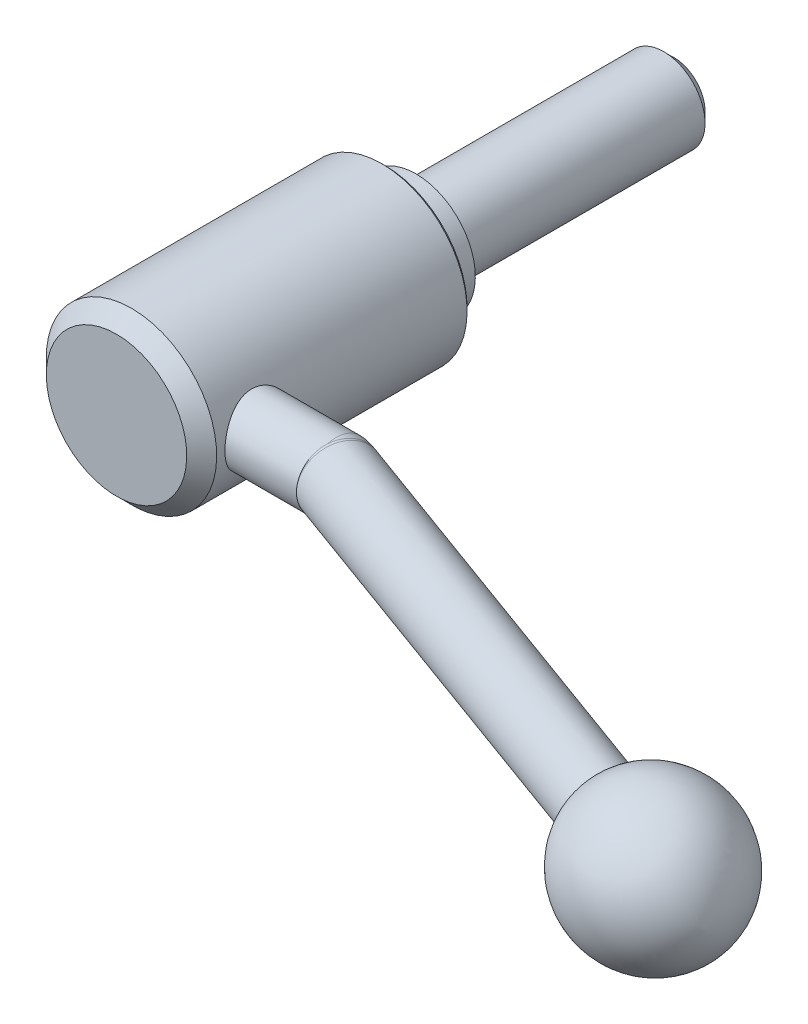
ISO-10303-21;
HEADER;
FILE_DESCRIPTION(('STEP AP214'),'2;1');
FILE_NAME('part.step','',(''),(''),'','','');
FILE_SCHEMA(('AUTOMOTIVE_DESIGN { 1 0 10303 214 1 1 1 1 }'));
ENDSEC;
DATA;
#1=APPLICATION_CONTEXT('core data for automotive mechanical design processes');
#2=APPLICATION_PROTOCOL_DEFINITION('international standard','automotive_design',2000,#1);
#3=PRODUCT_CONTEXT('',#1,'mechanical');
#4=PRODUCT('Part','Part','',(#3));
#5=PRODUCT_RELATED_PRODUCT_CATEGORY('part','',(#4));
#6=PRODUCT_DEFINITION_FORMATION('','',#4);
#7=PRODUCT_DEFINITION_CONTEXT('part definition',#1,'design');
#8=PRODUCT_DEFINITION('design','',#6,#7);
#9=PRODUCT_DEFINITION_SHAPE('','',#8);
#10=(LENGTH_UNIT() NAMED_UNIT(*) SI_UNIT(.MILLI.,.METRE.));
#11=(NAMED_UNIT(*) PLANE_ANGLE_UNIT() SI_UNIT($,.RADIAN.));
#12=(NAMED_UNIT(*) SI_UNIT($,.STERADIAN.) SOLID_ANGLE_UNIT());
#13=UNCERTAINTY_MEASURE_WITH_UNIT(LENGTH_MEASURE(1.E-05),#10,'distance_accuracy_value','');
#14=(GEOMETRIC_REPRESENTATION_CONTEXT(3) GLOBAL_UNCERTAINTY_ASSIGNED_CONTEXT((#13)) GLOBAL_UNIT_ASSIGNED_CONTEXT((#10,
#11,#12)) REPRESENTATION_CONTEXT('',''));
#15=CARTESIAN_POINT('',(0.,0.,0.));
#16=DIRECTION('',(0.,0.,1.));
#17=DIRECTION('',(1.,0.,0.));
#18=AXIS2_PLACEMENT_3D('',#15,#16,#17);
#19=CARTESIAN_POINT('',(0.,0.,0.));
#20=DIRECTION('',(0.,0.,-1.));
#21=DIRECTION('',(0.,1.,0.));
#22=AXIS2_PLACEMENT_3D('',#19,#20,#21);
#23=CYLINDRICAL_SURFACE('',#22,16.5);
#24=CARTESIAN_POINT('',(0.,0.,6.6));
#25=DIRECTION('',(0.,0.,-1.));
#26=DIRECTION('',(0.,1.,0.));
#27=AXIS2_PLACEMENT_3D('',#24,#25,#26);
#28=CIRCLE('',#27,16.5);
#29=CARTESIAN_POINT('',(0.,16.5,6.6));
#30=VERTEX_POINT('',#29);
#31=EDGE_CURVE('E147',#30,#30,#28,.T.);
#32=ORIENTED_EDGE('',*,*,#31,.F.);
#33=EDGE_LOOP('',(#32));
#34=FACE_BOUND('',#33,.T.);
#35=CARTESIAN_POINT('',(15.1657508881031,6.5,47.));
#36=CARTESIAN_POINT('',(15.1657521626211,6.49999870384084,47.1744094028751));
#37=CARTESIAN_POINT('',(15.1687696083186,6.49297069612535,47.3488754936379));
#38=CARTESIAN_POINT('',(15.180743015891,6.4649258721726,47.6965510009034));
#39=CARTESIAN_POINT('',(15.1897026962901,6.44390029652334,47.8697595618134));
#40=CARTESIAN_POINT('',(15.2132851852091,6.38802582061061,48.2139084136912));
#41=CARTESIAN_POINT('',(15.2279195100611,6.35314880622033,48.3848433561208));
#42=CARTESIAN_POINT('',(15.2623783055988,6.26991497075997,48.722930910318));
#43=CARTESIAN_POINT('',(15.2822049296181,6.22155255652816,48.890081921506));
#44=CARTESIAN_POINT('',(15.3263305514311,6.11204204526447,49.2187433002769));
#45=CARTESIAN_POINT('',(15.3506106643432,6.05094779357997,49.3802741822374));
#46=CARTESIAN_POINT('',(15.4029879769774,5.91634808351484,49.6975038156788));
#47=CARTESIAN_POINT('',(15.4310866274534,5.84283790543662,49.8532003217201));
#48=CARTESIAN_POINT('',(15.4902847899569,5.68403460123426,50.1577239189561));
#49=CARTESIAN_POINT('',(15.521382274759,5.59874941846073,50.3065555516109));
#50=CARTESIAN_POINT('',(15.5857773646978,5.41690395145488,50.5967321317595));
#51=CARTESIAN_POINT('',(15.6190757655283,5.32033957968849,50.7380743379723));
#52=CARTESIAN_POINT('',(15.6887204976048,5.11143504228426,51.0193834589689));
#53=CARTESIAN_POINT('',(15.7251359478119,4.99854682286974,51.1589265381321));
#54=CARTESIAN_POINT('',(15.7984684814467,4.76169722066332,51.4281356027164));
#55=CARTESIAN_POINT('',(15.8353855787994,4.6377355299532,51.5578013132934));
#56=CARTESIAN_POINT('',(15.9087724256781,4.37938333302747,51.8065762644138));
#57=CARTESIAN_POINT('',(15.9452419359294,4.24498750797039,51.9256800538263));
#58=CARTESIAN_POINT('',(16.0167582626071,3.96662276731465,52.1524872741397));
#59=CARTESIAN_POINT('',(16.0518055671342,3.82265718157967,52.2601946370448));
#60=CARTESIAN_POINT('',(16.1208941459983,3.52019152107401,52.467462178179));
#61=CARTESIAN_POINT('',(16.1548445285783,3.3613450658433,52.5665481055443));
#62=CARTESIAN_POINT('',(16.2192807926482,3.03521726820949,52.7508716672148));
#63=CARTESIAN_POINT('',(16.2497679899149,2.86793916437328,52.8361145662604));
#64=CARTESIAN_POINT('',(16.306415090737,2.52603369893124,52.9920322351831));
#65=CARTESIAN_POINT('',(16.3325754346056,2.35140708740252,53.062708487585));
#66=CARTESIAN_POINT('',(16.3798001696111,1.99606140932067,53.1888023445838));
#67=CARTESIAN_POINT('',(16.4008648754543,1.81534271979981,53.2442208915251));
#68=CARTESIAN_POINT('',(16.4364052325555,1.45784632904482,53.3369679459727));
#69=CARTESIAN_POINT('',(16.4511444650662,1.28128382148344,53.3750254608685));
#70=CARTESIAN_POINT('',(16.4750042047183,0.925236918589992,53.4363470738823));
#71=CARTESIAN_POINT('',(16.4841250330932,0.745752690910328,53.4596120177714));
#72=CARTESIAN_POINT('',(16.4964855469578,0.38532015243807,53.4910896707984));
#73=CARTESIAN_POINT('',(16.4997269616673,0.204372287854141,53.4993068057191));
#74=CARTESIAN_POINT('',(16.5002398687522,-0.157583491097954,53.500608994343));
#75=CARTESIAN_POINT('',(16.4975115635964,-0.33859140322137,53.4936945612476));
#76=CARTESIAN_POINT('',(16.4864766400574,-0.689328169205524,53.465606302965));
#77=CARTESIAN_POINT('',(16.4784837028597,-0.85913183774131,53.4452341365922));
#78=CARTESIAN_POINT('',(16.4574384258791,-1.19635679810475,53.3912360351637));
#79=CARTESIAN_POINT('',(16.444384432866,-1.36377729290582,53.3576057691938));
#80=CARTESIAN_POINT('',(16.4135516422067,-1.69498665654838,53.2774234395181));
#81=CARTESIAN_POINT('',(16.3957743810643,-1.85877668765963,53.2308755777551));
#82=CARTESIAN_POINT('',(16.3559249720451,-2.18179127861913,53.1252488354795));
#83=CARTESIAN_POINT('',(16.3338511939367,-2.34101407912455,53.0661651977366));
#84=CARTESIAN_POINT('',(16.2855961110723,-2.65615140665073,52.9350157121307));
#85=CARTESIAN_POINT('',(16.2593596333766,-2.81198390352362,52.8627732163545));
#86=CARTESIAN_POINT('',(16.2036445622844,-3.11704287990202,52.7064377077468));
#87=CARTESIAN_POINT('',(16.1741648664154,-3.26626708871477,52.6223406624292));
#88=CARTESIAN_POINT('',(16.1126670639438,-3.55725721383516,52.4428984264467));
#89=CARTESIAN_POINT('',(16.0806487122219,-3.69902240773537,52.3475521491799));
#90=CARTESIAN_POINT('',(16.0148235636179,-3.97435099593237,52.1462241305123));
#91=CARTESIAN_POINT('',(15.9810166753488,-4.10791397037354,52.0402418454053));
#92=CARTESIAN_POINT('',(15.9101988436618,-4.37444690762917,51.8111373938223));
#93=CARTESIAN_POINT('',(15.8731214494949,-4.50682971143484,51.687351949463));
#94=CARTESIAN_POINT('',(15.7988232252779,-4.76074389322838,51.4292307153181));
#95=CARTESIAN_POINT('',(15.7616024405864,-4.88227844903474,51.2948980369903));
#96=CARTESIAN_POINT('',(15.6879834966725,-5.11389804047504,51.0163266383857));
#97=CARTESIAN_POINT('',(15.6515859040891,-5.22397536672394,50.8720813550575));
#98=CARTESIAN_POINT('',(15.5806672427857,-5.43183822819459,50.5746385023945));
#99=CARTESIAN_POINT('',(15.5461454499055,-5.52962852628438,50.4214444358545));
#100=CARTESIAN_POINT('',(15.4790662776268,-5.71475871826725,50.1026478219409));
#101=CARTESIAN_POINT('',(15.4465879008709,-5.80174188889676,49.936821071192));
#102=CARTESIAN_POINT('',(15.3857195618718,-5.96128563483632,49.5977234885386));
#103=CARTESIAN_POINT('',(15.3573279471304,-6.03385204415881,49.4244557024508));
#104=CARTESIAN_POINT('',(15.3055990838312,-6.16388979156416,49.0716641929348));
#105=CARTESIAN_POINT('',(15.2822603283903,-6.22136563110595,48.8921423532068));
#106=CARTESIAN_POINT('',(15.2414756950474,-6.32062540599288,48.5281589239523));
#107=CARTESIAN_POINT('',(15.2240293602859,-6.36241055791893,48.3436977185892));
#108=CARTESIAN_POINT('',(15.1965377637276,-6.42778493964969,47.9824635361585));
#109=CARTESIAN_POINT('',(15.1861129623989,-6.45231123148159,47.8058886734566));
#110=CARTESIAN_POINT('',(15.1714222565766,-6.48677897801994,47.4510697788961));
#111=CARTESIAN_POINT('',(15.1671560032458,-6.4967212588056,47.2728258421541));
#112=CARTESIAN_POINT('',(15.1649343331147,-6.5019054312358,46.9161296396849));
#113=CARTESIAN_POINT('',(15.1669773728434,-6.49715091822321,46.7376774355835));
#114=CARTESIAN_POINT('',(15.1772980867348,-6.47300508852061,46.3819515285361));
#115=CARTESIAN_POINT('',(15.1855756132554,-6.45361411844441,46.2046777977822));
#116=CARTESIAN_POINT('',(15.2074545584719,-6.40187966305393,45.8623519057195));
#117=CARTESIAN_POINT('',(15.2207392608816,-6.37030447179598,45.6971624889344));
#118=CARTESIAN_POINT('',(15.2522135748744,-6.29457395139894,45.3701161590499));
#119=CARTESIAN_POINT('',(15.2704047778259,-6.25041454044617,45.2082603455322));
#120=CARTESIAN_POINT('',(15.3111508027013,-6.1499265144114,44.8889788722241));
#121=CARTESIAN_POINT('',(15.3337047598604,-6.09360031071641,44.7315523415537));
#122=CARTESIAN_POINT('',(15.3825547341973,-5.9692104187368,44.4219440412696));
#123=CARTESIAN_POINT('',(15.4088521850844,-5.90114223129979,44.2697643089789));
#124=CARTESIAN_POINT('',(15.4655807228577,-5.75087055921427,43.9656332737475));
#125=CARTESIAN_POINT('',(15.496133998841,-5.66821518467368,43.8139280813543));
#126=CARTESIAN_POINT('',(15.5596953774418,-5.4913305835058,43.5178983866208));
#127=CARTESIAN_POINT('',(15.5927043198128,-5.39709739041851,43.373576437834));
#128=CARTESIAN_POINT('',(15.6603145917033,-5.19765644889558,43.093084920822));
#129=CARTESIAN_POINT('',(15.6949161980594,-5.09244678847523,42.9569167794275));
#130=CARTESIAN_POINT('',(15.7648419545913,-4.87166967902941,42.6934495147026));
#131=CARTESIAN_POINT('',(15.8001661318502,-4.75610184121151,42.5661507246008));
#132=CARTESIAN_POINT('',(15.8732028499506,-4.50660710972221,42.3123157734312));
#133=CARTESIAN_POINT('',(15.910905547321,-4.37195833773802,42.1864851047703));
#134=CARTESIAN_POINT('',(15.985112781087,-4.09232041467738,41.9466012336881));
#135=CARTESIAN_POINT('',(16.0216176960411,-3.94733457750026,41.8325442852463));
#136=CARTESIAN_POINT('',(16.0924669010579,-3.64776716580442,41.6168903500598));
#137=CARTESIAN_POINT('',(16.1268102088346,-3.4931812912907,41.5152990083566));
#138=CARTESIAN_POINT('',(16.192362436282,-3.17548270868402,41.3254483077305));
#139=CARTESIAN_POINT('',(16.2235726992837,-3.01237370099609,41.2371832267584));
#140=CARTESIAN_POINT('',(16.2819868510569,-2.67872446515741,41.0747287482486));
#141=CARTESIAN_POINT('',(16.3091932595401,-2.50818899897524,41.0005304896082));
#142=CARTESIAN_POINT('',(16.3588360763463,-2.16084294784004,40.8668630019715));
#143=CARTESIAN_POINT('',(16.3812744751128,-1.98403501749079,40.8073876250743));
#144=CARTESIAN_POINT('',(16.4207336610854,-1.62543340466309,40.7037478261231));
#145=CARTESIAN_POINT('',(16.4377556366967,-1.44364082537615,40.6595800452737));
#146=CARTESIAN_POINT('',(16.4658759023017,-1.0764844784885,40.5870294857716));
#147=CARTESIAN_POINT('',(16.4769745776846,-0.89112094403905,40.5586456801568));
#148=CARTESIAN_POINT('',(16.4924035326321,-0.530232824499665,40.5192842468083));
#149=CARTESIAN_POINT('',(16.4971193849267,-0.354832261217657,40.5073144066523));
#150=CARTESIAN_POINT('',(16.5009342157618,-0.003578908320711,40.4976272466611));
#151=CARTESIAN_POINT('',(16.5000333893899,0.172273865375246,40.4999094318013));
#152=CARTESIAN_POINT('',(16.492639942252,0.523072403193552,40.5187002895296));
#153=CARTESIAN_POINT('',(16.4861480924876,0.698018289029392,40.5352070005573));
#154=CARTESIAN_POINT('',(16.4677497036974,1.04571908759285,40.5822707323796));
#155=CARTESIAN_POINT('',(16.4558431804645,1.21847400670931,40.6128277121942));
#156=CARTESIAN_POINT('',(16.427359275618,1.55551611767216,40.6865815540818));
#157=CARTESIAN_POINT('',(16.4109292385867,1.71990302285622,40.7293811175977));
#158=CARTESIAN_POINT('',(16.3736686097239,2.04442213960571,40.8275543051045));
#159=CARTESIAN_POINT('',(16.3528365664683,2.20455292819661,40.8829320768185));
#160=CARTESIAN_POINT('',(16.3072831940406,2.51948953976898,41.0057747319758));
#161=CARTESIAN_POINT('',(16.2825627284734,2.67429653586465,41.0732369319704));
#162=CARTESIAN_POINT('',(16.2298017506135,2.977796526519,41.2197632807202));
#163=CARTESIAN_POINT('',(16.201759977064,3.12648716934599,41.2988318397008));
#164=CARTESIAN_POINT('',(16.1417339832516,3.42320288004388,41.4716706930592));
#165=CARTESIAN_POINT('',(16.1096315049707,3.5709192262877,41.565929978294));
#166=CARTESIAN_POINT('',(16.0433028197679,3.85799821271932,41.7658374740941));
#167=CARTESIAN_POINT('',(16.0090758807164,3.99735794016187,41.8714896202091));
#168=CARTESIAN_POINT('',(15.9393375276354,4.266955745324,42.0935156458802));
#169=CARTESIAN_POINT('',(15.9038258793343,4.39719214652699,42.2098914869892));
#170=CARTESIAN_POINT('',(15.8323930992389,4.647828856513,42.4526787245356));
#171=CARTESIAN_POINT('',(15.796471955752,4.76822888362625,42.5790904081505));
#172=CARTESIAN_POINT('',(15.7229728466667,5.00544246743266,42.8491269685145));
#173=CARTESIAN_POINT('',(15.6854245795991,5.12160881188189,42.9933293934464));
#174=CARTESIAN_POINT('',(15.6119611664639,5.34135661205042,43.2913381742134));
#175=CARTESIAN_POINT('',(15.5760454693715,5.44494233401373,43.4451412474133));
#176=CARTESIAN_POINT('',(15.5068861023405,5.63889116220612,43.76158008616));
#177=CARTESIAN_POINT('',(15.4736440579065,5.72924625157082,43.9242211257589));
#178=CARTESIAN_POINT('',(15.4109193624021,5.89588782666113,44.2571658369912));
#179=CARTESIAN_POINT('',(15.3814348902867,5.9721811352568,44.427465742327));
#180=CARTESIAN_POINT('',(15.3295715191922,6.10399903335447,44.7594125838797));
#181=CARTESIAN_POINT('',(15.3067961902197,6.16075841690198,44.9205080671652));
#182=CARTESIAN_POINT('',(15.2658533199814,6.26152405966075,45.2471430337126));
#183=CARTESIAN_POINT('',(15.2476836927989,6.30553609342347,45.4126804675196));
#184=CARTESIAN_POINT('',(15.2165340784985,6.38033934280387,45.7467976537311));
#185=CARTESIAN_POINT('',(15.2035424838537,6.41116014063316,45.9153697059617));
#186=CARTESIAN_POINT('',(15.183110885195,6.45939917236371,46.2546841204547));
#187=CARTESIAN_POINT('',(15.1756675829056,6.4768253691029,46.4254251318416));
#188=CARTESIAN_POINT('',(15.1693292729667,6.49164558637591,46.6637445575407));
#189=CARTESIAN_POINT('',(15.1679883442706,6.49477751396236,46.7309454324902));
#190=CARTESIAN_POINT('',(15.1661988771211,6.49895503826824,46.8654280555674));
#191=CARTESIAN_POINT('',(15.1657503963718,6.50000050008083,46.9327098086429));
#192=CARTESIAN_POINT('',(15.1657508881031,6.5,47.));
#193=B_SPLINE_CURVE_WITH_KNOTS('',3,(#35,#36,#37,#38,#39,#40,#41,#42,#43,#44,#45,#46,#47,#48,
#49,#50,#51,#52,#53,#54,#55,#56,#57,#58,#59,#60,#61,#62,#63,#64,#65,#66,#67,#68,#69,#70,#71,#72,
#73,#74,#75,#76,#77,#78,#79,#80,#81,#82,#83,#84,#85,#86,#87,#88,#89,#90,#91,#92,#93,#94,#95,#96,
#97,#98,#99,#100,#101,#102,#103,#104,#105,#106,#107,#108,#109,#110,#111,#112,#113,#114,#115,
#116,#117,#118,#119,#120,#121,#122,#123,#124,#125,#126,#127,#128,#129,#130,#131,#132,#133,#134,
#135,#136,#137,#138,#139,#140,#141,#142,#143,#144,#145,#146,#147,#148,#149,#150,#151,#152,#153,
#154,#155,#156,#157,#158,#159,#160,#161,#162,#163,#164,#165,#166,#167,#168,#169,#170,#171,#172,
#173,#174,#175,#176,#177,#178,#179,#180,#181,#182,#183,#184,#185,#186,#187,#188,#189,#190,#191,
#192),.UNSPECIFIED.,.T.,.F.,(4,2,2,2,2,2,2,2,2,2,2,2,2,2,2,2,2,2,2,2,2,2,2,2,2,2,2,2,2,2,2,2,2,
2,2,2,2,2,2,2,2,2,2,2,2,2,2,2,2,2,2,2,2,2,2,2,2,2,2,2,2,2,2,2,2,2,2,2,2,2,2,2,2,2,2,2,2,2,4),
(0.,0.523159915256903,1.04664752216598,1.5712031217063,2.09597660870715,2.61857420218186,
3.14137090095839,3.66381663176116,4.18645228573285,4.73527747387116,5.28411792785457,
5.83324001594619,6.38217202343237,6.95226912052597,7.52214888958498,8.09197063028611,
8.66175716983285,9.20471085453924,9.74763349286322,10.2903964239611,10.8331409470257,
11.3461618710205,11.8593505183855,12.3723724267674,12.8855893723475,13.4062856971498,
13.9271595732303,14.4480838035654,14.9690346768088,15.5233891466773,16.0775806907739,
16.6321427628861,17.186489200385,17.755918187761,18.3251162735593,18.894144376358,
19.4631283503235,19.9981572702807,20.533155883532,21.0680236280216,21.6028787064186,
22.1084143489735,22.6141141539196,23.11971382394,23.6255076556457,24.1512658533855,
24.6772046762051,25.2032352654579,25.7292856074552,26.2929535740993,26.8564416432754,
27.4201839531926,27.9836835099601,28.5468269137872,29.1097347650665,29.6725190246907,
30.235266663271,30.7622239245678,31.2891628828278,31.8160291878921,32.3428939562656,
32.8542954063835,33.3658657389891,33.8773226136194,34.3889743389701,34.9228229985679,
35.4568566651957,35.990988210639,36.5251350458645,37.0912887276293,37.6572498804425,
38.2235525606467,38.7895797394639,39.3059532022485,39.8220923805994,40.3370679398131,
40.851737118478,41.0535682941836,41.2554125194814),.UNSPECIFIED.);
#194=CARTESIAN_POINT('',(15.1657508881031,6.5,47.));
#195=VERTEX_POINT('',#194);
#196=EDGE_CURVE('E77',#195,#195,#193,.T.);
#197=ORIENTED_EDGE('',*,*,#196,.F.);
#198=EDGE_LOOP('',(#197));
#199=FACE_BOUND('',#198,.T.);
#200=CARTESIAN_POINT('',(0.,0.,55.1));
#201=DIRECTION('',(0.,0.,-1.));
#202=DIRECTION('',(0.,1.,0.));
#203=AXIS2_PLACEMENT_3D('',#200,#201,#202);
#204=CIRCLE('',#203,16.5);
#205=CARTESIAN_POINT('',(0.,16.5,55.1));
#206=VERTEX_POINT('',#205);
#207=EDGE_CURVE('E149',#206,#206,#204,.T.);
#208=ORIENTED_EDGE('',*,*,#207,.T.);
#209=EDGE_LOOP('',(#208));
#210=FACE_BOUND('',#209,.T.);
#211=ADVANCED_FACE('F14',(#34,#199,#210),#23,.T.);
#212=CARTESIAN_POINT('',(0.,0.,58.));
#213=DIRECTION('',(0.,0.,-1.));
#214=DIRECTION('',(0.,1.,0.));
#215=AXIS2_PLACEMENT_3D('',#212,#213,#214);
#216=PLANE('',#215);
#217=CARTESIAN_POINT('',(0.,0.,58.));
#218=DIRECTION('',(0.,0.,-1.));
#219=DIRECTION('',(0.,1.,0.));
#220=AXIS2_PLACEMENT_3D('',#217,#218,#219);
#221=CIRCLE('',#220,13.6);
#222=CARTESIAN_POINT('',(0.,13.6,58.));
#223=VERTEX_POINT('',#222);
#224=EDGE_CURVE('E85',#223,#223,#221,.T.);
#225=ORIENTED_EDGE('',*,*,#224,.F.);
#226=EDGE_LOOP('',(#225));
#227=FACE_BOUND('',#226,.T.);
#228=ADVANCED_FACE('F61',(#227),#216,.F.);
#229=CARTESIAN_POINT('',(0.,0.,58.));
#230=DIRECTION('',(0.,0.,-1.));
#231=DIRECTION('',(0.,1.,0.));
#232=AXIS2_PLACEMENT_3D('',#229,#230,#231);
#233=CONICAL_SURFACE('',#232,13.6,0.785398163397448);
#234=ORIENTED_EDGE('',*,*,#207,.F.);
#235=EDGE_LOOP('',(#234));
#236=FACE_BOUND('',#235,.T.);
#237=ORIENTED_EDGE('',*,*,#224,.T.);
#238=EDGE_LOOP('',(#237));
#239=FACE_BOUND('',#238,.T.);
#240=ADVANCED_FACE('F67',(#236,#239),#233,.T.);
#241=CARTESIAN_POINT('',(0.,0.,6.6));
#242=DIRECTION('',(0.,0.,1.));
#243=DIRECTION('',(0.,-1.,0.));
#244=AXIS2_PLACEMENT_3D('',#241,#242,#243);
#245=CONICAL_SURFACE('',#244,16.5,0.785398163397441);
#246=CARTESIAN_POINT('',(0.,0.,6.));
#247=DIRECTION('',(0.,0.,-1.));
#248=DIRECTION('',(0.,1.,0.));
#249=AXIS2_PLACEMENT_3D('',#246,#247,#248);
#250=CIRCLE('',#249,15.9);
#251=CARTESIAN_POINT('',(0.,15.9,6.));
#252=VERTEX_POINT('',#251);
#253=EDGE_CURVE('E142',#252,#252,#250,.T.);
#254=ORIENTED_EDGE('',*,*,#253,.F.);
#255=EDGE_LOOP('',(#254));
#256=FACE_BOUND('',#255,.T.);
#257=ORIENTED_EDGE('',*,*,#31,.T.);
#258=EDGE_LOOP('',(#257));
#259=FACE_BOUND('',#258,.T.);
#260=ADVANCED_FACE('F74',(#256,#259),#245,.T.);
#261=CARTESIAN_POINT('',(15.9,0.,6.));
#262=DIRECTION('',(0.,0.,1.));
#263=DIRECTION('',(0.,-1.,0.));
#264=AXIS2_PLACEMENT_3D('',#261,#262,#263);
#265=PLANE('',#264);
#266=CARTESIAN_POINT('',(0.,0.,6.));
#267=DIRECTION('',(0.,0.,-1.));
#268=DIRECTION('',(0.,1.,0.));
#269=AXIS2_PLACEMENT_3D('',#266,#267,#268);
#270=CIRCLE('',#269,11.5);
#271=CARTESIAN_POINT('',(0.,11.5,6.));
#272=VERTEX_POINT('',#271);
#273=EDGE_CURVE('E140',#272,#272,#270,.T.);
#274=ORIENTED_EDGE('',*,*,#273,.F.);
#275=EDGE_LOOP('',(#274));
#276=FACE_BOUND('',#275,.T.);
#277=ORIENTED_EDGE('',*,*,#253,.T.);
#278=EDGE_LOOP('',(#277));
#279=FACE_BOUND('',#278,.T.);
#280=ADVANCED_FACE('F161',(#276,#279),#265,.F.);
#281=CARTESIAN_POINT('',(0.,0.,0.));
#282=DIRECTION('',(0.,0.,-1.));
#283=DIRECTION('',(0.,1.,0.));
#284=AXIS2_PLACEMENT_3D('',#281,#282,#283);
#285=CYLINDRICAL_SURFACE('',#284,11.5);
#286=CARTESIAN_POINT('',(0.,0.,0.));
#287=DIRECTION('',(0.,0.,-1.));
#288=DIRECTION('',(0.,1.,0.));
#289=AXIS2_PLACEMENT_3D('',#286,#287,#288);
#290=CIRCLE('',#289,11.5);
#291=CARTESIAN_POINT('',(0.,11.5,0.));
#292=VERTEX_POINT('',#291);
#293=EDGE_CURVE('E138',#292,#292,#290,.T.);
#294=ORIENTED_EDGE('',*,*,#293,.F.);
#295=EDGE_LOOP('',(#294));
#296=FACE_BOUND('',#295,.T.);
#297=ORIENTED_EDGE('',*,*,#273,.T.);
#298=EDGE_LOOP('',(#297));
#299=FACE_BOUND('',#298,.T.);
#300=ADVANCED_FACE('F135',(#296,#299),#285,.T.);
#301=CARTESIAN_POINT('',(11.5,0.,0.));
#302=DIRECTION('',(0.,0.,1.));
#303=DIRECTION('',(0.,-1.,0.));
#304=AXIS2_PLACEMENT_3D('',#301,#302,#303);
#305=PLANE('',#304);
#306=CARTESIAN_POINT('',(0.,0.,0.));
#307=DIRECTION('',(0.,0.,-1.));
#308=DIRECTION('',(0.,1.,0.));
#309=AXIS2_PLACEMENT_3D('',#306,#307,#308);
#310=CIRCLE('',#309,8.);
#311=CARTESIAN_POINT('',(0.,8.,0.));
#312=VERTEX_POINT('',#311);
#313=EDGE_CURVE('E126',#312,#312,#310,.T.);
#314=ORIENTED_EDGE('',*,*,#313,.F.);
#315=EDGE_LOOP('',(#314));
#316=FACE_BOUND('',#315,.T.);
#317=ORIENTED_EDGE('',*,*,#293,.T.);
#318=EDGE_LOOP('',(#317));
#319=FACE_BOUND('',#318,.T.);
#320=ADVANCED_FACE('F93',(#316,#319),#305,.F.);
#321=CARTESIAN_POINT('',(38.,0.,47.));
#322=DIRECTION('',(1.,0.,0.));
#323=DIRECTION('',(0.,1.,0.));
#324=AXIS2_PLACEMENT_3D('',#321,#322,#323);
#325=CYLINDRICAL_SURFACE('',#324,6.5);
#326=CARTESIAN_POINT('',(31.5002,-6.28048269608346,48.6749737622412));
#327=CARTESIAN_POINT('',(31.4701911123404,-6.25848550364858,48.7574684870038));
#328=CARTESIAN_POINT('',(31.4414052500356,-6.2347500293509,48.8399237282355));
#329=CARTESIAN_POINT('',(31.3859523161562,-6.18381246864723,49.0044625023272));
#330=CARTESIAN_POINT('',(31.3592849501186,-6.15661086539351,49.0865460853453));
#331=CARTESIAN_POINT('',(31.2819864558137,-6.06984393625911,49.3317442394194));
#332=CARTESIAN_POINT('',(31.234026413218,-6.00509209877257,49.4938982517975));
#333=CARTESIAN_POINT('',(31.1437652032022,-5.86212891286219,49.8135555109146));
#334=CARTESIAN_POINT('',(31.1014588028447,-5.78393016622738,49.971062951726));
#335=CARTESIAN_POINT('',(31.0215196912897,-5.61443273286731,50.2801227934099));
#336=CARTESIAN_POINT('',(30.9838873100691,-5.52313312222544,50.4316747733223));
#337=CARTESIAN_POINT('',(30.9127228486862,-5.32805112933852,50.7273614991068));
#338=CARTESIAN_POINT('',(30.8791877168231,-5.22427815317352,50.871501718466));
#339=CARTESIAN_POINT('',(30.815774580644,-5.00483968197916,51.1512875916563));
#340=CARTESIAN_POINT('',(30.7858966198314,-4.88917404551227,51.2869331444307));
#341=CARTESIAN_POINT('',(30.7295154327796,-4.64671898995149,51.548605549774));
#342=CARTESIAN_POINT('',(30.7030116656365,-4.51993135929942,51.6746339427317));
#343=CARTESIAN_POINT('',(30.6531671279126,-4.25605741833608,51.9160918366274));
#344=CARTESIAN_POINT('',(30.6298263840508,-4.1189710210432,52.0315212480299));
#345=CARTESIAN_POINT('',(30.5859306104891,-3.83395076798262,52.2520111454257));
#346=CARTESIAN_POINT('',(30.5654071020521,-3.68591886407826,52.3569512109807));
#347=CARTESIAN_POINT('',(30.527316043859,-3.38127311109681,52.5542722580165));
#348=CARTESIAN_POINT('',(30.5097495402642,-3.22465625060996,52.6466487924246));
#349=CARTESIAN_POINT('',(30.4775004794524,-2.90402878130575,52.8180456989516));
#350=CARTESIAN_POINT('',(30.4628174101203,-2.74001949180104,52.8970684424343));
#351=CARTESIAN_POINT('',(30.4362651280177,-2.40569424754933,53.0411738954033));
#352=CARTESIAN_POINT('',(30.424396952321,-2.23537599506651,53.1062514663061));
#353=CARTESIAN_POINT('',(30.4035252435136,-1.89117431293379,53.2214241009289));
#354=CARTESIAN_POINT('',(30.3944984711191,-1.71733288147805,53.2716404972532));
#355=CARTESIAN_POINT('',(30.3791416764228,-1.3658896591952,53.3574425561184));
#356=CARTESIAN_POINT('',(30.3728126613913,-1.18828648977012,53.3930227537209));
#357=CARTESIAN_POINT('',(30.3628391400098,-0.830755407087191,53.4492305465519));
#358=CARTESIAN_POINT('',(30.3591931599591,-0.650828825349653,53.4698663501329));
#359=CARTESIAN_POINT('',(30.3545680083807,-0.289765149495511,53.496061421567));
#360=CARTESIAN_POINT('',(30.3535900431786,-0.108627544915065,53.5016138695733));
#361=CARTESIAN_POINT('',(30.3542996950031,0.252555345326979,53.4975893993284));
#362=CARTESIAN_POINT('',(30.355973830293,0.432601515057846,53.4880890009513));
#363=CARTESIAN_POINT('',(30.3619660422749,0.79115770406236,53.4541833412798));
#364=CARTESIAN_POINT('',(30.3662829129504,0.969668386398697,53.429784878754));
#365=CARTESIAN_POINT('',(30.3775753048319,1.32405576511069,53.3662625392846));
#366=CARTESIAN_POINT('',(30.384552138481,1.49993111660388,53.3271313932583));
#367=CARTESIAN_POINT('',(30.4011832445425,1.84764570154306,53.2344660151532));
#368=CARTESIAN_POINT('',(30.4108365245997,2.01948640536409,53.1809371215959));
#369=CARTESIAN_POINT('',(30.4328583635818,2.35804742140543,53.0598634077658));
#370=CARTESIAN_POINT('',(30.4452278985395,2.52476586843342,52.9923135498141));
#371=CARTESIAN_POINT('',(30.4727213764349,2.85178734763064,52.843761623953));
#372=CARTESIAN_POINT('',(30.4878443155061,3.01209269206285,52.7627644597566));
#373=CARTESIAN_POINT('',(30.5209144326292,3.32526997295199,52.5879110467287));
#374=CARTESIAN_POINT('',(30.5388622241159,3.47814028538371,52.4940520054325));
#375=CARTESIAN_POINT('',(30.5776589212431,3.77530504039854,52.2942532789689));
#376=CARTESIAN_POINT('',(30.5985068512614,3.91960234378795,52.1883176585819));
#377=CARTESIAN_POINT('',(30.6433408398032,4.19941993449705,51.9645872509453));
#378=CARTESIAN_POINT('',(30.6673426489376,4.33489069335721,51.8467336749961));
#379=CARTESIAN_POINT('',(30.7185603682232,4.59531298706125,51.6005655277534));
#380=CARTESIAN_POINT('',(30.7457763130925,4.72026440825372,51.4722508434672));
#381=CARTESIAN_POINT('',(30.8036465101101,4.95882988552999,51.20617837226));
#382=CARTESIAN_POINT('',(30.8343011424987,5.07244268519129,51.0684195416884));
#383=CARTESIAN_POINT('',(30.8993555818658,5.28757920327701,50.7846019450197));
#384=CARTESIAN_POINT('',(30.9337552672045,5.38910331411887,50.6385434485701));
#385=CARTESIAN_POINT('',(31.0048466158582,5.5744837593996,50.3471450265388));
#386=CARTESIAN_POINT('',(31.0413260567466,5.65898432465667,50.2021627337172));
#387=CARTESIAN_POINT('',(31.1186048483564,5.81610839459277,49.9070309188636));
#388=CARTESIAN_POINT('',(31.1594036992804,5.88873327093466,49.7568819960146));
#389=CARTESIAN_POINT('',(31.2461889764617,6.0218129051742,49.4526179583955));
#390=CARTESIAN_POINT('',(31.2921778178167,6.08226196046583,49.2985010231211));
#391=CARTESIAN_POINT('',(31.366062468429,6.16360062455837,49.0656236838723));
#392=CARTESIAN_POINT('',(31.3915152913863,6.18916346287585,48.9876924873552));
#393=CARTESIAN_POINT('',(31.4443438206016,6.23716716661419,48.8315099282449));
#394=CARTESIAN_POINT('',(31.4717197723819,6.25960763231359,48.753258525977));
#395=CARTESIAN_POINT('',(31.5001999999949,6.28048269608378,48.6749737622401));
#396=B_SPLINE_CURVE_WITH_KNOTS('',3,(#326,#327,#328,#329,#330,#331,#332,#333,#334,#335,#336,
#337,#338,#339,#340,#341,#342,#343,#344,#345,#346,#347,#348,#349,#350,#351,#352,#353,#354,#355,
#356,#357,#358,#359,#360,#361,#362,#363,#364,#365,#366,#367,#368,#369,#370,#371,#372,#373,#374,
#375,#376,#377,#378,#379,#380,#381,#382,#383,#384,#385,#386,#387,#388,#389,#390,#391,#392,#393,
#394,#395),.UNSPECIFIED.,.F.,.F.,(4,2,2,2,2,2,2,2,2,2,2,2,2,2,2,2,2,2,2,2,2,2,2,2,2,2,2,2,2,2,2,
2,2,2,4),(0.,0.27143395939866,0.542830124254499,1.08532167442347,1.62730757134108,
2.16933170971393,2.71094964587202,3.25257402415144,3.79411146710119,4.3356534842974,
4.88283172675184,5.43020315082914,5.97747727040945,6.52495270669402,7.06782653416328,
7.61090287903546,8.15368070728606,8.69670390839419,9.23697554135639,9.77700080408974,
10.3172928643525,10.8573848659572,11.3976712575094,11.9377610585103,12.4779683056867,
13.0179942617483,13.5608276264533,14.1036668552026,14.6465661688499,15.1894478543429,
15.7040975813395,16.2186878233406,16.733518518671,16.9910761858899,17.2486667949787),.UNSPECIFIED.);
#397=CARTESIAN_POINT('',(31.5,-6.28033613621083,48.6755232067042));
#398=VERTEX_POINT('',#397);
#399=CARTESIAN_POINT('',(30.3538746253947,0.,53.5));
#400=VERTEX_POINT('',#399);
#401=EDGE_CURVE('E29',#398,#400,#396,.T.);
#402=ORIENTED_EDGE('',*,*,#401,.T.);
#403=CARTESIAN_POINT('',(31.5,6.28033613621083,48.6755232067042));
#404=VERTEX_POINT('',#403);
#405=EDGE_CURVE('E98',#400,#404,#396,.T.);
#406=ORIENTED_EDGE('',*,*,#405,.T.);
#407=CARTESIAN_POINT('',(31.5,0.,47.));
#408=DIRECTION('',(1.,0.,0.));
#409=DIRECTION('',(0.,1.,0.));
#410=AXIS2_PLACEMENT_3D('',#407,#408,#409);
#411=CIRCLE('',#410,6.5);
#412=EDGE_CURVE('E107',#398,#404,#411,.T.);
#413=ORIENTED_EDGE('',*,*,#412,.F.);
#414=EDGE_LOOP('',(#402,#406,#413));
#415=FACE_BOUND('',#414,.T.);
#416=ORIENTED_EDGE('',*,*,#196,.T.);
#417=EDGE_LOOP('',(#416));
#418=FACE_BOUND('',#417,.T.);
#419=ADVANCED_FACE('F87',(#415,#418),#325,.T.);
#420=CARTESIAN_POINT('',(31.5,0.,47.));
#421=DIRECTION('',(1.,0.,0.));
#422=DIRECTION('',(0.,0.,-1.));
#423=AXIS2_PLACEMENT_3D('',#420,#421,#422);
#424=SPHERICAL_SURFACE('',#423,6.5);
#425=CARTESIAN_POINT('',(32.0385027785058,0.,47.1959989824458));
#426=DIRECTION('',(0.939692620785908,0.,0.342020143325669));
#427=DIRECTION('',(-0.342020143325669,0.,0.939692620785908));
#428=AXIS2_PLACEMENT_3D('',#425,#426,#427);
#429=CIRCLE('',#428,6.47468911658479);
#430=EDGE_CURVE('E36',#398,#404,#429,.T.);
#431=ORIENTED_EDGE('',*,*,#430,.F.);
#432=ORIENTED_EDGE('',*,*,#412,.T.);
#433=EDGE_LOOP('',(#431,#432));
#434=FACE_BOUND('',#433,.T.);
#435=ADVANCED_FACE('F92',(#434),#424,.T.);
#436=CARTESIAN_POINT('',(32.5770055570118,0.,47.3919979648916));
#437=DIRECTION('',(0.939692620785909,0.,0.342020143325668));
#438=DIRECTION('',(-0.342020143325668,0.,0.939692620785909));
#439=AXIS2_PLACEMENT_3D('',#436,#437,#438);
#440=SPHERICAL_SURFACE('',#439,6.5);
#441=ORIENTED_EDGE('',*,*,#401,.F.);
#442=ORIENTED_EDGE('',*,*,#430,.T.);
#443=ORIENTED_EDGE('',*,*,#405,.F.);
#444=CARTESIAN_POINT('',(32.5770055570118,0.,47.3919979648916));
#445=DIRECTION('',(0.939692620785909,0.,0.342020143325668));
#446=DIRECTION('',(-0.342020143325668,0.,0.939692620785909));
#447=AXIS2_PLACEMENT_3D('',#444,#445,#446);
#448=CIRCLE('',#447,6.5);
#449=EDGE_CURVE('E105',#400,#400,#448,.T.);
#450=ORIENTED_EDGE('',*,*,#449,.F.);
#451=EDGE_LOOP('',(#441,#442,#443,#450));
#452=FACE_BOUND('',#451,.T.);
#453=ADVANCED_FACE('F109',(#452),#440,.T.);
#454=CARTESIAN_POINT('',(143.071394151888,0.,87.6086664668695));
#455=DIRECTION('',(0.939692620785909,0.,0.342020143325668));
#456=DIRECTION('',(-0.342020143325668,0.,0.939692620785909));
#457=AXIS2_PLACEMENT_3D('',#454,#455,#456);
#458=CYLINDRICAL_SURFACE('',#457,6.5);
#459=CARTESIAN_POINT('',(116.052479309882,0.,77.774585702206));
#460=DIRECTION('',(0.939692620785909,0.,0.342020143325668));
#461=DIRECTION('',(-0.342020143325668,0.,0.939692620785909));
#462=AXIS2_PLACEMENT_3D('',#459,#460,#461);
#463=CIRCLE('',#462,6.5);
#464=CARTESIAN_POINT('',(113.829348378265,0.,83.8825877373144));
#465=VERTEX_POINT('',#464);
#466=EDGE_CURVE('E121',#465,#465,#463,.T.);
#467=ORIENTED_EDGE('',*,*,#466,.F.);
#468=EDGE_LOOP('',(#467));
#469=FACE_BOUND('',#468,.T.);
#470=ORIENTED_EDGE('',*,*,#449,.T.);
#471=EDGE_LOOP('',(#470));
#472=FACE_BOUND('',#471,.T.);
#473=ADVANCED_FACE('F56',(#469,#472),#458,.T.);
#474=CARTESIAN_POINT('',(113.829348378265,0.,83.8825877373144));
#475=DIRECTION('',(0.939692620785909,0.,0.342020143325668));
#476=DIRECTION('',(-0.342020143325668,0.,0.939692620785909));
#477=AXIS2_PLACEMENT_3D('',#474,#475,#476);
#478=PLANE('',#477);
#479=CARTESIAN_POINT('',(116.052479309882,0.,77.774585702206));
#480=DIRECTION('',(0.939692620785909,0.,0.342020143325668));
#481=DIRECTION('',(-0.342020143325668,0.,0.939692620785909));
#482=AXIS2_PLACEMENT_3D('',#479,#480,#481);
#483=CIRCLE('',#482,8.37359520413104);
#484=CARTESIAN_POINT('',(113.188541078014,0.,85.6431913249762));
#485=VERTEX_POINT('',#484);
#486=EDGE_CURVE('E124',#485,#485,#483,.T.);
#487=ORIENTED_EDGE('',*,*,#486,.F.);
#488=EDGE_LOOP('',(#487));
#489=FACE_BOUND('',#488,.T.);
#490=ORIENTED_EDGE('',*,*,#466,.T.);
#491=EDGE_LOOP('',(#490));
#492=FACE_BOUND('',#491,.T.);
#493=ADVANCED_FACE('F45',(#489,#492),#478,.F.);
#494=CARTESIAN_POINT('',(128.5,0.,81.));
#495=DIRECTION('',(0.,1.,0.));
#496=DIRECTION('',(-0.342020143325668,0.,0.939692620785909));
#497=AXIS2_PLACEMENT_3D('',#494,#495,#496);
#498=CIRCLE('',#497,16.);
#499=TRIMMED_CURVE('',#498,(PARAMETER_VALUE(-1.49407077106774)),
(PARAMETER_VALUE(1.49407077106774)),.T.,.PARAMETER.);
#500=CARTESIAN_POINT('',(128.080544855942,0.,82.1524435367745));
#501=DIRECTION('',(0.939692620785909,0.,0.342020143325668));
#502=AXIS1_PLACEMENT('',#500,#501);
#503=SURFACE_OF_REVOLUTION('',#499,#502);
#504=ORIENTED_EDGE('',*,*,#486,.T.);
#505=EDGE_LOOP('',(#504));
#506=FACE_BOUND('',#505,.T.);
#507=CARTESIAN_POINT('',(143.071394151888,0.,87.6086664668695));
#508=VERTEX_POINT('',#507);
#509=VERTEX_LOOP('',#508);
#510=FACE_BOUND('',#509,.T.);
#511=ADVANCED_FACE('F42',(#506,#510),#503,.T.);
#512=CARTESIAN_POINT('',(0.,0.,23.));
#513=DIRECTION('',(0.,0.,-1.));
#514=DIRECTION('',(-1.,0.,0.));
#515=AXIS2_PLACEMENT_3D('',#512,#513,#514);
#516=CYLINDRICAL_SURFACE('',#515,8.);
#517=CARTESIAN_POINT('',(0.,0.,-48.));
#518=DIRECTION('',(0.,0.,-1.));
#519=DIRECTION('',(-1.,0.,0.));
#520=AXIS2_PLACEMENT_3D('',#517,#518,#519);
#521=CIRCLE('',#520,8.);
#522=CARTESIAN_POINT('',(-8.,0.,-48.));
#523=VERTEX_POINT('',#522);
#524=EDGE_CURVE('E9',#523,#523,#521,.F.);
#525=ORIENTED_EDGE('',*,*,#524,.T.);
#526=EDGE_LOOP('',(#525));
#527=FACE_BOUND('',#526,.T.);
#528=ORIENTED_EDGE('',*,*,#313,.T.);
#529=EDGE_LOOP('',(#528));
#530=FACE_BOUND('',#529,.T.);
#531=ADVANCED_FACE('F44',(#527,#530),#516,.T.);
#532=CARTESIAN_POINT('',(0.,0.,-50.));
#533=DIRECTION('',(0.,0.,-1.));
#534=DIRECTION('',(-1.,0.,0.));
#535=AXIS2_PLACEMENT_3D('',#532,#533,#534);
#536=PLANE('',#535);
#537=CARTESIAN_POINT('',(0.,0.,-50.));
#538=DIRECTION('',(0.,0.,-1.));
#539=DIRECTION('',(-1.,0.,0.));
#540=AXIS2_PLACEMENT_3D('',#537,#538,#539);
#541=CIRCLE('',#540,6.00000000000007);
#542=CARTESIAN_POINT('',(-6.00000000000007,0.,-50.));
#543=VERTEX_POINT('',#542);
#544=EDGE_CURVE('E22',#543,#543,#541,.T.);
#545=ORIENTED_EDGE('',*,*,#544,.T.);
#546=EDGE_LOOP('',(#545));
#547=FACE_BOUND('',#546,.T.);
#548=ADVANCED_FACE('F53',(#547),#536,.T.);
#549=CARTESIAN_POINT('',(0.,0.,-50.));
#550=DIRECTION('',(0.,0.,1.));
#551=DIRECTION('',(1.,0.,0.));
#552=AXIS2_PLACEMENT_3D('',#549,#550,#551);
#553=CONICAL_SURFACE('',#552,6.,0.785398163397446);
#554=ORIENTED_EDGE('',*,*,#524,.F.);
#555=EDGE_LOOP('',(#554));
#556=FACE_BOUND('',#555,.T.);
#557=ORIENTED_EDGE('',*,*,#544,.F.);
#558=EDGE_LOOP('',(#557));
#559=FACE_BOUND('',#558,.T.);
#560=ADVANCED_FACE('F16',(#556,#559),#553,.T.);
#561=CLOSED_SHELL('',(#211,#228,#240,#260,#280,#300,#320,#419,#435,#453,#473,#493,#511,#531,
#548,#560));
#562=MANIFOLD_SOLID_BREP('B1',#561);
#563=ADVANCED_BREP_SHAPE_REPRESENTATION('',(#18,#562),#14);
#564=SHAPE_DEFINITION_REPRESENTATION(#9,#563);
ENDSEC;
END-ISO-10303-21;
